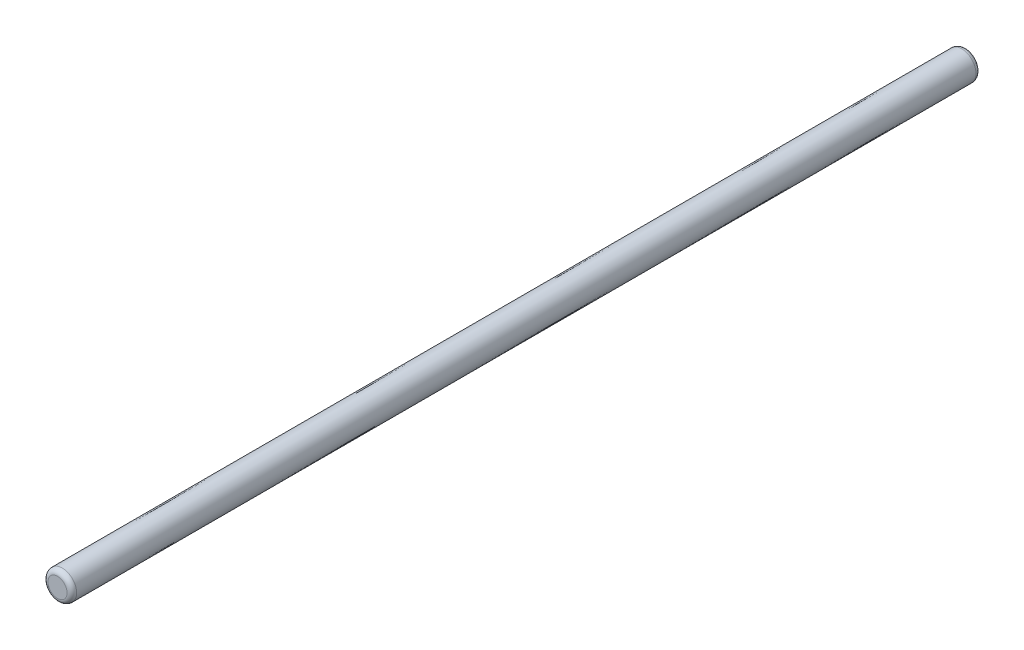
ISO-10303-21;
HEADER;
FILE_DESCRIPTION(('STEP AP214'),'2;1');
FILE_NAME('part.step','',(''),(''),'','','');
FILE_SCHEMA(('AUTOMOTIVE_DESIGN { 1 0 10303 214 1 1 1 1 }'));
ENDSEC;
DATA;
#1=APPLICATION_CONTEXT('core data for automotive mechanical design processes');
#2=APPLICATION_PROTOCOL_DEFINITION('international standard','automotive_design',2000,#1);
#3=PRODUCT_CONTEXT('',#1,'mechanical');
#4=PRODUCT('Part','Part','',(#3));
#5=PRODUCT_RELATED_PRODUCT_CATEGORY('part','',(#4));
#6=PRODUCT_DEFINITION_FORMATION('','',#4);
#7=PRODUCT_DEFINITION_CONTEXT('part definition',#1,'design');
#8=PRODUCT_DEFINITION('design','',#6,#7);
#9=PRODUCT_DEFINITION_SHAPE('','',#8);
#10=(LENGTH_UNIT() NAMED_UNIT(*) SI_UNIT(.MILLI.,.METRE.));
#11=(NAMED_UNIT(*) PLANE_ANGLE_UNIT() SI_UNIT($,.RADIAN.));
#12=(NAMED_UNIT(*) SI_UNIT($,.STERADIAN.) SOLID_ANGLE_UNIT());
#13=UNCERTAINTY_MEASURE_WITH_UNIT(LENGTH_MEASURE(1.E-05),#10,'distance_accuracy_value','');
#14=(GEOMETRIC_REPRESENTATION_CONTEXT(3) GLOBAL_UNCERTAINTY_ASSIGNED_CONTEXT((#13)) GLOBAL_UNIT_ASSIGNED_CONTEXT((#10,
#11,#12)) REPRESENTATION_CONTEXT('',''));
#15=CARTESIAN_POINT('',(0.,0.,0.));
#16=DIRECTION('',(0.,0.,1.));
#17=DIRECTION('',(1.,0.,0.));
#18=AXIS2_PLACEMENT_3D('',#15,#16,#17);
#19=CARTESIAN_POINT('',(0.,0.,-47.5));
#20=DIRECTION('',(0.,0.,1.));
#21=DIRECTION('',(1.,0.,0.));
#22=AXIS2_PLACEMENT_3D('',#19,#20,#21);
#23=PLANE('',#22);
#24=CARTESIAN_POINT('',(0.,0.,-47.5));
#25=DIRECTION('',(0.,0.,1.));
#26=DIRECTION('',(1.,0.,0.));
#27=AXIS2_PLACEMENT_3D('',#24,#25,#26);
#28=CIRCLE('',#27,1.);
#29=CARTESIAN_POINT('',(1.,0.,-47.5));
#30=VERTEX_POINT('',#29);
#31=EDGE_CURVE('E42',#30,#30,#28,.F.);
#32=ORIENTED_EDGE('',*,*,#31,.T.);
#33=EDGE_LOOP('',(#32));
#34=FACE_BOUND('',#33,.T.);
#35=ADVANCED_FACE('F26',(#34),#23,.F.);
#36=CARTESIAN_POINT('',(0.,0.,-47.));
#37=DIRECTION('',(0.,0.,1.));
#38=DIRECTION('',(1.,0.,0.));
#39=AXIS2_PLACEMENT_3D('',#36,#37,#38);
#40=TOROIDAL_SURFACE('',#39,1.,0.5);
#41=ORIENTED_EDGE('',*,*,#31,.F.);
#42=EDGE_LOOP('',(#41));
#43=FACE_BOUND('',#42,.T.);
#44=CARTESIAN_POINT('',(0.,0.,-47.));
#45=DIRECTION('',(0.,0.,1.));
#46=DIRECTION('',(1.,0.,0.));
#47=AXIS2_PLACEMENT_3D('',#44,#45,#46);
#48=CIRCLE('',#47,1.5);
#49=CARTESIAN_POINT('',(1.5,0.,-47.));
#50=VERTEX_POINT('',#49);
#51=EDGE_CURVE('E30',#50,#50,#48,.F.);
#52=ORIENTED_EDGE('',*,*,#51,.T.);
#53=EDGE_LOOP('',(#52));
#54=FACE_BOUND('',#53,.T.);
#55=ADVANCED_FACE('F63',(#43,#54),#40,.T.);
#56=CARTESIAN_POINT('',(-1.49999999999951,2.80935940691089E-13,47.0000000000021));
#57=CARTESIAN_POINT('',(-1.49999999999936,0.,43.2400000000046));
#58=CARTESIAN_POINT('',(-1.50000000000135,-3.52284535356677E-13,35.7199999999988));
#59=CARTESIAN_POINT('',(-1.4999999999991,1.39785142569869E-13,24.4400000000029));
#60=CARTESIAN_POINT('',(-1.50000000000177,0.,9.39999999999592));
#61=CARTESIAN_POINT('',(-1.49999999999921,0.,-9.39999999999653));
#62=CARTESIAN_POINT('',(-1.50000000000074,-2.06914361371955E-13,-24.4400000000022));
#63=CARTESIAN_POINT('',(-1.50000000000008,1.16189182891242E-13,-35.7200000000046));
#64=CARTESIAN_POINT('',(-1.49999999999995,0.,-43.2399999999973));
#65=CARTESIAN_POINT('',(-1.49999999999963,0.,-46.9999999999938));
#66=CARTESIAN_POINT('',(-1.49999999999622,-0.285714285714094,47.0000000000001));
#67=CARTESIAN_POINT('',(-1.49999999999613,-0.285714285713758,43.2399999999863));
#68=CARTESIAN_POINT('',(-1.50000000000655,-0.285714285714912,35.7200000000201));
#69=CARTESIAN_POINT('',(-1.49999999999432,-0.285714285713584,24.4399999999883));
#70=CARTESIAN_POINT('',(-1.50000000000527,-0.28571428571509,9.4000000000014));
#71=CARTESIAN_POINT('',(-1.49999999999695,-0.285714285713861,-9.40000000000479));
#72=CARTESIAN_POINT('',(-1.5000000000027,-0.285714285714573,-24.4399999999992));
#73=CARTESIAN_POINT('',(-1.49999999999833,-0.285714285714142,-35.7199999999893));
#74=CARTESIAN_POINT('',(-1.50000000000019,-0.285714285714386,-43.2400000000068));
#75=CARTESIAN_POINT('',(-1.50000000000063,-0.285714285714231,-47.0000000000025));
#76=CARTESIAN_POINT('',(-1.33561643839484,-1.06849315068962,46.9999999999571));
#77=CARTESIAN_POINT('',(-1.33561643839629,-1.06849315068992,43.2400000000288));
#78=CARTESIAN_POINT('',(-1.33561643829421,-1.06849315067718,35.7199999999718));
#79=CARTESIAN_POINT('',(-1.33561643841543,-1.06849315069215,24.4400000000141));
#80=CARTESIAN_POINT('',(-1.33561643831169,-1.06849315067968,9.39999999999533));
#81=CARTESIAN_POINT('',(-1.33561643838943,-1.06849315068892,-9.39999999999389));
#82=CARTESIAN_POINT('',(-1.33561643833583,-1.06849315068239,-24.4400000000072));
#83=CARTESIAN_POINT('',(-1.33561643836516,-1.06849315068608,-35.7200000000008));
#84=CARTESIAN_POINT('',(-1.33561643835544,-1.06849315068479,-43.2399999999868));
#85=CARTESIAN_POINT('',(-1.33561643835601,-1.06849315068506,-47.000000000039));
#86=CARTESIAN_POINT('',(-0.424528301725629,-2.03773584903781,47.0000000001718));
#87=CARTESIAN_POINT('',(-0.424528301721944,-2.03773584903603,43.2399999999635));
#88=CARTESIAN_POINT('',(-0.424528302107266,-2.03773584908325,35.7199999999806));
#89=CARTESIAN_POINT('',(-0.424528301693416,-2.03773584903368,24.4400000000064));
#90=CARTESIAN_POINT('',(-0.424528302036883,-2.03773584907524,9.40000000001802));
#91=CARTESIAN_POINT('',(-0.424528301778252,-2.03773584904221,-9.40000000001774));
#92=CARTESIAN_POINT('',(-0.424528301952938,-2.03773584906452,-24.4399999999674));
#93=CARTESIAN_POINT('',(-0.424528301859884,-2.037735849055,-35.7200000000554));
#94=CARTESIAN_POINT('',(-0.424528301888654,-2.03773584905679,-43.2400000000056));
#95=CARTESIAN_POINT('',(-0.424528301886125,-2.03773584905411,-46.9999999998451));
#96=CARTESIAN_POINT('',(0.905172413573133,-1.73275862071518,46.9999999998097));
#97=CARTESIAN_POINT('',(0.905172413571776,-1.73275862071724,43.2400000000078));
#98=CARTESIAN_POINT('',(0.905172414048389,-1.73275862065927,35.7200000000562));
#99=CARTESIAN_POINT('',(0.905172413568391,-1.73275862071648,24.4399999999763));
#100=CARTESIAN_POINT('',(0.905172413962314,-1.7327586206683,9.39999999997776));
#101=CARTESIAN_POINT('',(0.905172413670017,-1.73275862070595,-9.39999999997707));
#102=CARTESIAN_POINT('',(0.905172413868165,-1.73275862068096,-24.4400000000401));
#103=CARTESIAN_POINT('',(0.905172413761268,-1.73275862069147,-35.7199999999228));
#104=CARTESIAN_POINT('',(0.905172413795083,-1.73275862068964,-43.2400000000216));
#105=CARTESIAN_POINT('',(0.905172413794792,-1.73275862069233,-47.0000000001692));
#106=CARTESIAN_POINT('',(1.44886363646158,-0.630681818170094,47.0000000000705));
#107=CARTESIAN_POINT('',(1.44886363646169,-0.630681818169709,43.2400000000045));
#108=CARTESIAN_POINT('',(1.44886363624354,-0.630681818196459,35.7199999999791));
#109=CARTESIAN_POINT('',(1.44886363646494,-0.630681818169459,24.4400000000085));
#110=CARTESIAN_POINT('',(1.44886363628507,-0.630681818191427,9.40000000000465));
#111=CARTESIAN_POINT('',(1.44886363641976,-0.630681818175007,-9.40000000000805));
#112=CARTESIAN_POINT('',(1.44886363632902,-0.630681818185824,-24.4399999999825));
#113=CARTESIAN_POINT('',(1.44886363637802,-0.630681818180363,-35.7200000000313));
#114=CARTESIAN_POINT('',(1.44886363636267,-0.630681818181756,-43.2399999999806));
#115=CARTESIAN_POINT('',(1.44886363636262,-0.630681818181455,-46.999999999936));
#116=CARTESIAN_POINT('',(1.49999999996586,-0.130434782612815,46.9999999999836));
#117=CARTESIAN_POINT('',(1.49999999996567,-0.130434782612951,43.2399999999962));
#118=CARTESIAN_POINT('',(1.5000000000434,-0.130434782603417,35.7199999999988));
#119=CARTESIAN_POINT('',(1.49999999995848,-0.130434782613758,24.439999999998));
#120=CARTESIAN_POINT('',(1.50000000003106,-0.130434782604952,9.4000000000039));
#121=CARTESIAN_POINT('',(1.49999999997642,-0.130434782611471,-9.39999999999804));
#122=CARTESIAN_POINT('',(1.50000000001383,-0.130434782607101,-24.4400000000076));
#123=CARTESIAN_POINT('',(1.49999999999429,-0.13043478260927,-35.7199999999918));
#124=CARTESIAN_POINT('',(1.50000000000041,-0.130434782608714,-43.2400000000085));
#125=CARTESIAN_POINT('',(1.50000000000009,-0.130434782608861,-47.0000000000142));
#126=CARTESIAN_POINT('',(1.4999999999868,-1.65181761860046E-12,46.9999999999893));
#127=CARTESIAN_POINT('',(1.49999999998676,-1.66955857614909E-12,43.2399999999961));
#128=CARTESIAN_POINT('',(1.50000000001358,1.71506208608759E-12,35.7199999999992));
#129=CARTESIAN_POINT('',(1.49999999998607,-1.76028033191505E-12,24.4399999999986));
#130=CARTESIAN_POINT('',(1.5000000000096,1.11281607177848E-12,9.40000000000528));
#131=CARTESIAN_POINT('',(1.4999999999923,-8.35813594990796E-13,-9.40000000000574));
#132=CARTESIAN_POINT('',(1.50000000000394,4.7322146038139E-13,-24.4399999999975));
#133=CARTESIAN_POINT('',(1.49999999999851,-1.91498961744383E-13,-35.7199999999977));
#134=CARTESIAN_POINT('',(1.50000000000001,0.,-43.2400000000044));
#135=CARTESIAN_POINT('',(1.50000000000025,0.,-47.0000000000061));
#136=CARTESIAN_POINT('',(1.50000000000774,0.13043478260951,46.9999999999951));
#137=CARTESIAN_POINT('',(1.50000000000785,0.130434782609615,43.2399999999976));
#138=CARTESIAN_POINT('',(1.49999999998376,0.130434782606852,35.7199999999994));
#139=CARTESIAN_POINT('',(1.50000000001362,0.130434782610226,24.439999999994));
#140=CARTESIAN_POINT('',(1.4999999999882,0.130434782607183,9.40000000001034));
#141=CARTESIAN_POINT('',(1.50000000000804,0.130434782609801,-9.40000000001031));
#142=CARTESIAN_POINT('',(1.49999999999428,0.130434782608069,-24.4399999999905));
#143=CARTESIAN_POINT('',(1.50000000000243,0.130434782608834,-35.7200000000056));
#144=CARTESIAN_POINT('',(1.49999999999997,0.130434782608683,-43.2399999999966));
#145=CARTESIAN_POINT('',(1.49999999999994,0.130434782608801,-47.0000000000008));
#146=CARTESIAN_POINT('',(1.44886363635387,0.630681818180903,47.0000000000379));
#147=CARTESIAN_POINT('',(1.44886363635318,0.6306818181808,43.2400000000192));
#148=CARTESIAN_POINT('',(1.44886363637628,0.630681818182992,35.7199999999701));
#149=CARTESIAN_POINT('',(1.44886363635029,0.630681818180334,24.4400000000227));
#150=CARTESIAN_POINT('',(1.44886363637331,0.630681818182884,9.39999999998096));
#151=CARTESIAN_POINT('',(1.4488636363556,0.630681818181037,-9.39999999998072));
#152=CARTESIAN_POINT('',(1.4488636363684,0.630681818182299,-24.4400000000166));
#153=CARTESIAN_POINT('',(1.44886363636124,0.630681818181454,-35.7199999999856));
#154=CARTESIAN_POINT('',(1.44886363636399,0.630681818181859,-43.2400000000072));
#155=CARTESIAN_POINT('',(1.44886363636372,0.630681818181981,-47.0000000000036));
#156=CARTESIAN_POINT('',(0.905172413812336,1.73275862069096,46.9999999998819));
#157=CARTESIAN_POINT('',(0.905172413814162,1.73275862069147,43.2399999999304));
#158=CARTESIAN_POINT('',(0.905172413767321,1.73275862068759,35.7200000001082));
#159=CARTESIAN_POINT('',(0.905172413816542,1.73275862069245,24.4399999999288));
#160=CARTESIAN_POINT('',(0.9051724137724,1.73275862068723,9.40000000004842));
#161=CARTESIAN_POINT('',(0.905172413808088,1.73275862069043,-9.40000000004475));
#162=CARTESIAN_POINT('',(0.905172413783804,1.73275862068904,-24.4399999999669));
#163=CARTESIAN_POINT('',(0.905172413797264,1.73275862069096,-35.7200000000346));
#164=CARTESIAN_POINT('',(0.905172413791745,1.7327586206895,-43.2399999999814));
#165=CARTESIAN_POINT('',(0.90517241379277,1.73275862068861,-46.9999999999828));
#166=CARTESIAN_POINT('',(-0.424528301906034,2.03773584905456,47.0000000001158));
#167=CARTESIAN_POINT('',(-0.424528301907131,2.03773584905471,43.2400000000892));
#168=CARTESIAN_POINT('',(-0.424528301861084,2.03773584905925,35.7199999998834));
#169=CARTESIAN_POINT('',(-0.424528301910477,2.03773584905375,24.4400000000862));
#170=CARTESIAN_POINT('',(-0.424528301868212,2.03773584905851,9.39999999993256));
#171=CARTESIAN_POINT('',(-0.424528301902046,2.03773584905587,-9.39999999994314));
#172=CARTESIAN_POINT('',(-0.424528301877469,2.03773584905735,-24.4400000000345));
#173=CARTESIAN_POINT('',(-0.424528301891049,2.03773584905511,-35.7199999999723));
#174=CARTESIAN_POINT('',(-0.424528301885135,2.03773584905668,-43.2400000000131));
#175=CARTESIAN_POINT('',(-0.424528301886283,2.03773584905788,-47.0000000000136));
#176=CARTESIAN_POINT('',(-1.3356164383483,1.06849315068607,46.9999999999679));
#177=CARTESIAN_POINT('',(-1.33561643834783,1.06849315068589,43.2399999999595));
#178=CARTESIAN_POINT('',(-1.33561643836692,1.06849315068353,35.7200000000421));
#179=CARTESIAN_POINT('',(-1.33561643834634,1.06849315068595,24.4399999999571));
#180=CARTESIAN_POINT('',(-1.33561643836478,1.06849315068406,9.40000000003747));
#181=CARTESIAN_POINT('',(-1.33561643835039,1.06849315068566,-9.40000000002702));
#182=CARTESIAN_POINT('',(-1.33561643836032,1.06849315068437,-24.4399999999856));
#183=CARTESIAN_POINT('',(-1.33561643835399,1.06849315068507,-35.7200000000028));
#184=CARTESIAN_POINT('',(-1.33561643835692,1.06849315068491,-43.2400000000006));
#185=CARTESIAN_POINT('',(-1.3356164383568,1.06849315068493,-47.0000000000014));
#186=CARTESIAN_POINT('',(-1.50000000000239,0.285714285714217,47.0000000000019));
#187=CARTESIAN_POINT('',(-1.50000000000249,0.285714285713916,43.2400000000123));
#188=CARTESIAN_POINT('',(-1.49999999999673,0.285714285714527,35.7199999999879));
#189=CARTESIAN_POINT('',(-1.50000000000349,0.28571428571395,24.4400000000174));
#190=CARTESIAN_POINT('',(-1.49999999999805,0.285714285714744,9.39999999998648));
#191=CARTESIAN_POINT('',(-1.50000000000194,0.285714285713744,-9.39999999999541));
#192=CARTESIAN_POINT('',(-1.49999999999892,0.285714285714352,-24.4400000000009));
#193=CARTESIAN_POINT('',(-1.50000000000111,0.285714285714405,-35.7200000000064));
#194=CARTESIAN_POINT('',(-1.49999999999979,0.285714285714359,-43.2399999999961));
#195=CARTESIAN_POINT('',(-1.49999999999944,0.285714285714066,-46.9999999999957));
#196=CARTESIAN_POINT('',(-1.49999999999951,2.80935940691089E-13,47.0000000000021));
#197=CARTESIAN_POINT('',(-1.49999999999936,0.,43.2400000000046));
#198=CARTESIAN_POINT('',(-1.50000000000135,-3.52284535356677E-13,35.7199999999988));
#199=CARTESIAN_POINT('',(-1.4999999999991,1.39785142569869E-13,24.4400000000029));
#200=CARTESIAN_POINT('',(-1.50000000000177,0.,9.39999999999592));
#201=CARTESIAN_POINT('',(-1.49999999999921,0.,-9.39999999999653));
#202=CARTESIAN_POINT('',(-1.50000000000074,-2.06914361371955E-13,-24.4400000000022));
#203=CARTESIAN_POINT('',(-1.50000000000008,1.16189182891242E-13,-35.7200000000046));
#204=CARTESIAN_POINT('',(-1.49999999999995,0.,-43.2399999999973));
#205=CARTESIAN_POINT('',(-1.49999999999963,0.,-46.9999999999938));
#206=(BOUNDED_SURFACE() B_SPLINE_SURFACE(5,5,((#56,#57,#58,#59,#60,#61,#62,#63,#64,#65),(#66,
#67,#68,#69,#70,#71,#72,#73,#74,#75),(#76,#77,#78,#79,#80,#81,#82,#83,#84,#85),(#86,#87,#88,#89,
#90,#91,#92,#93,#94,#95),(#96,#97,#98,#99,#100,#101,#102,#103,#104,#105),(#106,#107,#108,#109,
#110,#111,#112,#113,#114,#115),(#116,#117,#118,#119,#120,#121,#122,#123,#124,#125),(#126,#127,
#128,#129,#130,#131,#132,#133,#134,#135),(#136,#137,#138,#139,#140,#141,#142,#143,#144,#145),
(#146,#147,#148,#149,#150,#151,#152,#153,#154,#155),(#156,#157,#158,#159,#160,#161,#162,#163,
#164,#165),(#166,#167,#168,#169,#170,#171,#172,#173,#174,#175),(#176,#177,#178,#179,#180,#181,
#182,#183,#184,#185),(#186,#187,#188,#189,#190,#191,#192,#193,#194,#195),(#196,#197,#198,#199,
#200,#201,#202,#203,#204,#205)),.UNSPECIFIED.,.T.,.F.,.F.) B_SPLINE_SURFACE_WITH_KNOTS((6,1,1,5,
1,1,6),(6,1,1,1,1,6),(0.,0.6,1.2,1.5,1.8,2.4,3.),(0.,0.6,1.2,1.8,2.4,3.),
.UNSPECIFIED.) GEOMETRIC_REPRESENTATION_ITEM() RATIONAL_B_SPLINE_SURFACE(((0.999999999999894,
1.00000000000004,1.0000000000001,0.999999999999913,0.999999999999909,1.00000000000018,
1.00000000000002,0.999999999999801,0.999999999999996,1.00000000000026),(0.84000000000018,
0.839999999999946,0.83999999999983,0.840000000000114,0.840000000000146,0.839999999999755,
0.83999999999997,0.840000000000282,0.84000000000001,0.839999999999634),(0.5839999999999,
0.584000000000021,0.584000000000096,0.583999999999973,0.583999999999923,0.584000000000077,
0.58400000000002,0.583999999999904,0.583999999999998,0.584000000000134),(0.423999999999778,
0.424000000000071,0.42400000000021,0.423999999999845,0.423999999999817,0.424000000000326,
0.424000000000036,0.423999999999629,0.423999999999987,0.424000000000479),(0.464000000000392,
0.463999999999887,0.463999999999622,0.464000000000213,0.464000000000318,0.463999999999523,
0.463999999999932,0.464000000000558,0.464000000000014,0.463999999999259),(0.703999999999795,
0.704000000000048,0.704000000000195,0.703999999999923,0.70399999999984,0.704000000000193,
0.704000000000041,0.70399999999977,0.703999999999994,0.704000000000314),(0.919999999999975,
0.920000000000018,0.920000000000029,0.919999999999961,0.919999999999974,0.920000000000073,
0.919999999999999,0.919999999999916,0.919999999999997,0.920000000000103),(1.00000000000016,
0.999999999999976,0.999999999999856,1.00000000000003,1.00000000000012,0.999999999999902,
0.999999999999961,1.00000000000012,1.,0.999999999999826),(0.919999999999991,0.919999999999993,
0.920000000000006,0.920000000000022,0.919999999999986,0.919999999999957,0.920000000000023,
0.920000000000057,0.91999999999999,0.919999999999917),(0.70399999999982,0.704000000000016,
0.704000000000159,0.703999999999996,0.703999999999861,0.70400000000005,0.704000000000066,
0.703999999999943,0.703999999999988,0.704000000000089),(0.464000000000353,0.463999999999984,
0.46399999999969,0.46399999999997,0.46400000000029,0.463999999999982,0.46399999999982,
0.463999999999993,0.464000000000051,0.464000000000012),(0.423999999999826,0.424000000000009,
0.424000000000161,0.424000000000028,0.423999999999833,0.423999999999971,0.424000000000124,
0.424000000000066,0.423999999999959,0.423999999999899),(0.583999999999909,0.584000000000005,
0.584000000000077,0.584000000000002,0.583999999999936,0.584000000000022,0.58400000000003,
0.583999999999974,0.583999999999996,0.584000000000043),(0.840000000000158,0.839999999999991,
0.839999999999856,0.839999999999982,0.840000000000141,0.840000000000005,0.839999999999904,
0.839999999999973,0.84000000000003,0.840000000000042),(0.999999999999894,1.00000000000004,
1.0000000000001,0.999999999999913,0.999999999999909,1.00000000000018,1.00000000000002,
0.999999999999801,0.999999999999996,1.00000000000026))) REPRESENTATION_ITEM('') SURFACE());
#207=CARTESIAN_POINT('',(0.,0.,47.));
#208=DIRECTION('',(0.,0.,1.));
#209=DIRECTION('',(1.,0.,0.));
#210=AXIS2_PLACEMENT_3D('',#207,#208,#209);
#211=CIRCLE('',#210,1.5);
#212=CARTESIAN_POINT('',(1.5,-8.25908809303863E-13,47.));
#213=VERTEX_POINT('',#212);
#214=EDGE_CURVE('E36',#213,#213,#211,.F.);
#215=ORIENTED_EDGE('',*,*,#51,.F.);
#216=EDGE_LOOP('',(#215));
#217=FACE_BOUND('',#216,.T.);
#218=ORIENTED_EDGE('',*,*,#214,.T.);
#219=EDGE_LOOP('',(#218));
#220=FACE_BOUND('',#219,.T.);
#221=ADVANCED_FACE('F58',(#217,#220),#206,.F.);
#222=CARTESIAN_POINT('',(0.,0.,47.));
#223=DIRECTION('',(0.,0.,1.));
#224=DIRECTION('',(1.,0.,0.));
#225=AXIS2_PLACEMENT_3D('',#222,#223,#224);
#226=TOROIDAL_SURFACE('',#225,1.,0.5);
#227=ORIENTED_EDGE('',*,*,#214,.F.);
#228=EDGE_LOOP('',(#227));
#229=FACE_BOUND('',#228,.T.);
#230=CARTESIAN_POINT('',(0.,0.,47.5));
#231=DIRECTION('',(0.,0.,1.));
#232=DIRECTION('',(1.,0.,0.));
#233=AXIS2_PLACEMENT_3D('',#230,#231,#232);
#234=CIRCLE('',#233,1.);
#235=CARTESIAN_POINT('',(1.,0.,47.5));
#236=VERTEX_POINT('',#235);
#237=EDGE_CURVE('E11',#236,#236,#234,.T.);
#238=ORIENTED_EDGE('',*,*,#237,.F.);
#239=EDGE_LOOP('',(#238));
#240=FACE_BOUND('',#239,.T.);
#241=ADVANCED_FACE('F52',(#229,#240),#226,.T.);
#242=CARTESIAN_POINT('',(0.,0.,47.5));
#243=DIRECTION('',(0.,0.,1.));
#244=DIRECTION('',(1.,0.,0.));
#245=AXIS2_PLACEMENT_3D('',#242,#243,#244);
#246=PLANE('',#245);
#247=ORIENTED_EDGE('',*,*,#237,.T.);
#248=EDGE_LOOP('',(#247));
#249=FACE_BOUND('',#248,.T.);
#250=ADVANCED_FACE('F28',(#249),#246,.T.);
#251=CLOSED_SHELL('',(#35,#55,#221,#241,#250));
#252=MANIFOLD_SOLID_BREP('B2',#251);
#253=ADVANCED_BREP_SHAPE_REPRESENTATION('',(#18,#252),#14);
#254=SHAPE_DEFINITION_REPRESENTATION(#9,#253);
ENDSEC;
END-ISO-10303-21;
